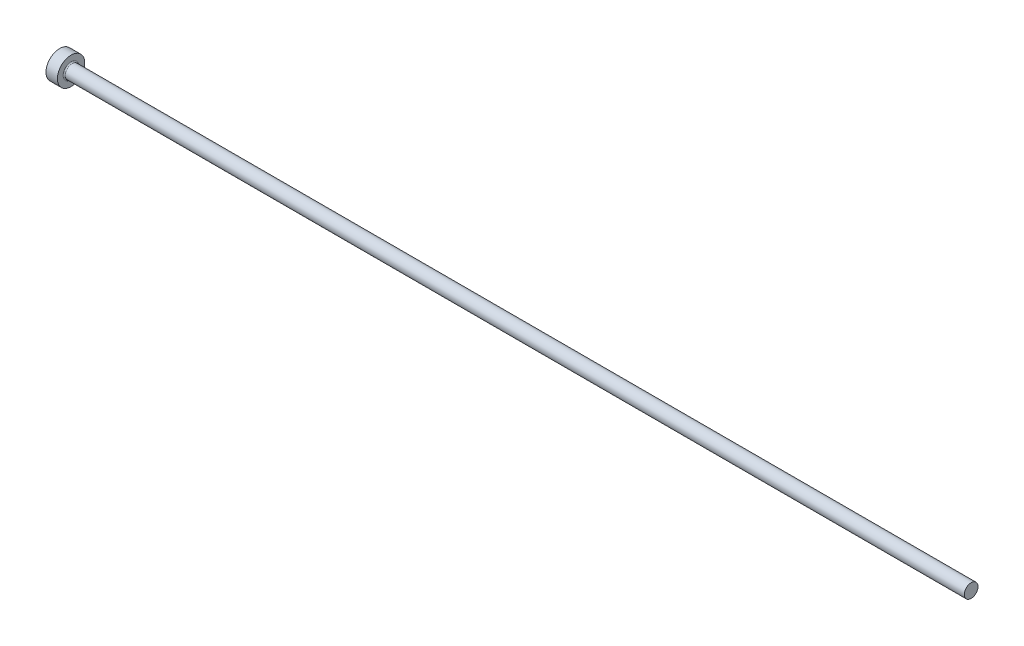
ISO-10303-21;
HEADER;
FILE_DESCRIPTION(('STEP AP214'),'2;1');
FILE_NAME('part.step','',(''),(''),'','','');
FILE_SCHEMA(('AUTOMOTIVE_DESIGN { 1 0 10303 214 1 1 1 1 }'));
ENDSEC;
DATA;
#1=APPLICATION_CONTEXT('core data for automotive mechanical design processes');
#2=APPLICATION_PROTOCOL_DEFINITION('international standard','automotive_design',2000,#1);
#3=PRODUCT_CONTEXT('',#1,'mechanical');
#4=PRODUCT('Part','Part','',(#3));
#5=PRODUCT_RELATED_PRODUCT_CATEGORY('part','',(#4));
#6=PRODUCT_DEFINITION_FORMATION('','',#4);
#7=PRODUCT_DEFINITION_CONTEXT('part definition',#1,'design');
#8=PRODUCT_DEFINITION('design','',#6,#7);
#9=PRODUCT_DEFINITION_SHAPE('','',#8);
#10=(LENGTH_UNIT() NAMED_UNIT(*) SI_UNIT(.MILLI.,.METRE.));
#11=(NAMED_UNIT(*) PLANE_ANGLE_UNIT() SI_UNIT($,.RADIAN.));
#12=(NAMED_UNIT(*) SI_UNIT($,.STERADIAN.) SOLID_ANGLE_UNIT());
#13=UNCERTAINTY_MEASURE_WITH_UNIT(LENGTH_MEASURE(1.E-05),#10,'distance_accuracy_value','');
#14=(GEOMETRIC_REPRESENTATION_CONTEXT(3) GLOBAL_UNCERTAINTY_ASSIGNED_CONTEXT((#13)) GLOBAL_UNIT_ASSIGNED_CONTEXT((#10,
#11,#12)) REPRESENTATION_CONTEXT('',''));
#15=CARTESIAN_POINT('',(0.,0.,0.));
#16=DIRECTION('',(0.,0.,1.));
#17=DIRECTION('',(1.,0.,0.));
#18=AXIS2_PLACEMENT_3D('',#15,#16,#17);
#19=CARTESIAN_POINT('',(0.,0.,0.));
#20=DIRECTION('',(-1.,0.,0.));
#21=DIRECTION('',(0.,-1.,0.));
#22=AXIS2_PLACEMENT_3D('',#19,#20,#21);
#23=PLANE('',#22);
#24=CARTESIAN_POINT('',(0.,0.,0.));
#25=DIRECTION('',(1.,0.,0.));
#26=DIRECTION('',(0.,1.,0.));
#27=AXIS2_PLACEMENT_3D('',#24,#25,#26);
#28=CIRCLE('',#27,6.);
#29=CARTESIAN_POINT('',(0.,6.,0.));
#30=VERTEX_POINT('',#29);
#31=EDGE_CURVE('E25',#30,#30,#28,.T.);
#32=ORIENTED_EDGE('',*,*,#31,.F.);
#33=EDGE_LOOP('',(#32));
#34=FACE_BOUND('',#33,.T.);
#35=ADVANCED_FACE('F14',(#34),#23,.T.);
#36=CARTESIAN_POINT('',(400.,0.,0.));
#37=DIRECTION('',(1.,0.,0.));
#38=DIRECTION('',(0.,1.,0.));
#39=AXIS2_PLACEMENT_3D('',#36,#37,#38);
#40=CYLINDRICAL_SURFACE('',#39,6.);
#41=ORIENTED_EDGE('',*,*,#31,.T.);
#42=EDGE_LOOP('',(#41));
#43=FACE_BOUND('',#42,.T.);
#44=CARTESIAN_POINT('',(5.,0.,0.));
#45=DIRECTION('',(1.,0.,0.));
#46=DIRECTION('',(0.,1.,0.));
#47=AXIS2_PLACEMENT_3D('',#44,#45,#46);
#48=CIRCLE('',#47,6.);
#49=CARTESIAN_POINT('',(5.,6.,0.));
#50=VERTEX_POINT('',#49);
#51=EDGE_CURVE('E29',#50,#50,#48,.T.);
#52=ORIENTED_EDGE('',*,*,#51,.F.);
#53=EDGE_LOOP('',(#52));
#54=FACE_BOUND('',#53,.T.);
#55=ADVANCED_FACE('F51',(#43,#54),#40,.T.);
#56=CARTESIAN_POINT('',(5.,6.,0.));
#57=DIRECTION('',(1.,0.,0.));
#58=DIRECTION('',(0.,1.,0.));
#59=AXIS2_PLACEMENT_3D('',#56,#57,#58);
#60=PLANE('',#59);
#61=CARTESIAN_POINT('',(5.,0.,0.));
#62=DIRECTION('',(1.,0.,0.));
#63=DIRECTION('',(0.,1.,0.));
#64=AXIS2_PLACEMENT_3D('',#61,#62,#63);
#65=CIRCLE('',#64,3.49999999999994);
#66=CARTESIAN_POINT('',(5.,3.49999999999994,0.));
#67=VERTEX_POINT('',#66);
#68=EDGE_CURVE('E9',#67,#67,#65,.F.);
#69=ORIENTED_EDGE('',*,*,#68,.T.);
#70=EDGE_LOOP('',(#69));
#71=FACE_BOUND('',#70,.T.);
#72=ORIENTED_EDGE('',*,*,#51,.T.);
#73=EDGE_LOOP('',(#72));
#74=FACE_BOUND('',#73,.T.);
#75=ADVANCED_FACE('F42',(#71,#74),#60,.T.);
#76=CARTESIAN_POINT('',(400.,0.,0.));
#77=DIRECTION('',(1.,0.,0.));
#78=DIRECTION('',(0.,1.,0.));
#79=AXIS2_PLACEMENT_3D('',#76,#77,#78);
#80=CYLINDRICAL_SURFACE('',#79,2.99999999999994);
#81=CARTESIAN_POINT('',(5.5,0.,0.));
#82=DIRECTION('',(1.,0.,0.));
#83=DIRECTION('',(0.,1.,0.));
#84=AXIS2_PLACEMENT_3D('',#81,#82,#83);
#85=CIRCLE('',#84,2.99999999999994);
#86=CARTESIAN_POINT('',(5.5,2.99999999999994,0.));
#87=VERTEX_POINT('',#86);
#88=EDGE_CURVE('E21',#87,#87,#85,.T.);
#89=ORIENTED_EDGE('',*,*,#88,.T.);
#90=EDGE_LOOP('',(#89));
#91=FACE_BOUND('',#90,.T.);
#92=CARTESIAN_POINT('',(400.,0.,0.));
#93=DIRECTION('',(1.,0.,0.));
#94=DIRECTION('',(0.,1.,0.));
#95=AXIS2_PLACEMENT_3D('',#92,#93,#94);
#96=CIRCLE('',#95,2.99999999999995);
#97=CARTESIAN_POINT('',(400.,2.99999999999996,0.));
#98=VERTEX_POINT('',#97);
#99=EDGE_CURVE('E34',#98,#98,#96,.T.);
#100=ORIENTED_EDGE('',*,*,#99,.F.);
#101=EDGE_LOOP('',(#100));
#102=FACE_BOUND('',#101,.T.);
#103=ADVANCED_FACE('F40',(#91,#102),#80,.T.);
#104=CARTESIAN_POINT('',(400.,2.99999999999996,0.));
#105=DIRECTION('',(1.,0.,0.));
#106=DIRECTION('',(0.,1.,0.));
#107=AXIS2_PLACEMENT_3D('',#104,#105,#106);
#108=PLANE('',#107);
#109=ORIENTED_EDGE('',*,*,#99,.T.);
#110=EDGE_LOOP('',(#109));
#111=FACE_BOUND('',#110,.T.);
#112=ADVANCED_FACE('F38',(#111),#108,.T.);
#113=CARTESIAN_POINT('',(5.5,0.,0.));
#114=DIRECTION('',(1.,0.,0.));
#115=DIRECTION('',(0.,1.,0.));
#116=AXIS2_PLACEMENT_3D('',#113,#114,#115);
#117=TOROIDAL_SURFACE('',#116,3.49999999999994,0.5);
#118=ORIENTED_EDGE('',*,*,#68,.F.);
#119=EDGE_LOOP('',(#118));
#120=FACE_BOUND('',#119,.T.);
#121=ORIENTED_EDGE('',*,*,#88,.F.);
#122=EDGE_LOOP('',(#121));
#123=FACE_BOUND('',#122,.T.);
#124=ADVANCED_FACE('F16',(#120,#123),#117,.F.);
#125=CLOSED_SHELL('',(#35,#55,#75,#103,#112,#124));
#126=MANIFOLD_SOLID_BREP('B1',#125);
#127=ADVANCED_BREP_SHAPE_REPRESENTATION('',(#18,#126),#14);
#128=SHAPE_DEFINITION_REPRESENTATION(#9,#127);
ENDSEC;
END-ISO-10303-21;
